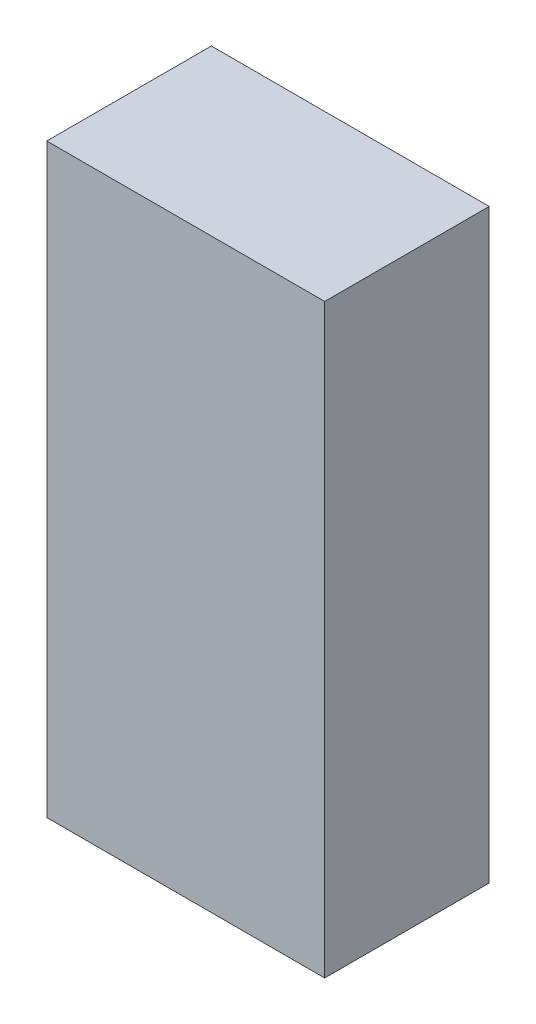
ISO-10303-21;
HEADER;
FILE_DESCRIPTION(('STEP AP214'),'2;1');
FILE_NAME('part.step','',(''),(''),'','','');
FILE_SCHEMA(('AUTOMOTIVE_DESIGN { 1 0 10303 214 1 1 1 1 }'));
ENDSEC;
DATA;
#1=APPLICATION_CONTEXT('core data for automotive mechanical design processes');
#2=APPLICATION_PROTOCOL_DEFINITION('international standard','automotive_design',2000,#1);
#3=PRODUCT_CONTEXT('',#1,'mechanical');
#4=PRODUCT('Part','Part','',(#3));
#5=PRODUCT_RELATED_PRODUCT_CATEGORY('part','',(#4));
#6=PRODUCT_DEFINITION_FORMATION('','',#4);
#7=PRODUCT_DEFINITION_CONTEXT('part definition',#1,'design');
#8=PRODUCT_DEFINITION('design','',#6,#7);
#9=PRODUCT_DEFINITION_SHAPE('','',#8);
#10=(LENGTH_UNIT() NAMED_UNIT(*) SI_UNIT(.MILLI.,.METRE.));
#11=(NAMED_UNIT(*) PLANE_ANGLE_UNIT() SI_UNIT($,.RADIAN.));
#12=(NAMED_UNIT(*) SI_UNIT($,.STERADIAN.) SOLID_ANGLE_UNIT());
#13=UNCERTAINTY_MEASURE_WITH_UNIT(LENGTH_MEASURE(1.E-05),#10,'distance_accuracy_value','');
#14=(GEOMETRIC_REPRESENTATION_CONTEXT(3) GLOBAL_UNCERTAINTY_ASSIGNED_CONTEXT((#13)) GLOBAL_UNIT_ASSIGNED_CONTEXT((#10,
#11,#12)) REPRESENTATION_CONTEXT('',''));
#15=CARTESIAN_POINT('',(0.,0.,0.));
#16=DIRECTION('',(0.,0.,1.));
#17=DIRECTION('',(1.,0.,0.));
#18=AXIS2_PLACEMENT_3D('',#15,#16,#17);
#19=CARTESIAN_POINT('',(0.76000102,1.60250124,0.9));
#20=DIRECTION('',(0.,0.,-1.));
#21=DIRECTION('',(-1.,0.,0.));
#22=AXIS2_PLACEMENT_3D('',#19,#20,#21);
#23=PLANE('',#22);
#24=DIRECTION('',(0.,1.,0.));
#25=VECTOR('',#24,1.);
#26=CARTESIAN_POINT('',(-0.75999848,1.60250124,0.9));
#27=LINE('',#26,#25);
#28=CARTESIAN_POINT('',(-0.75999848,1.60250124,0.9));
#29=VERTEX_POINT('',#28);
#30=CARTESIAN_POINT('',(-0.75999848,-1.6024987,0.9));
#31=VERTEX_POINT('',#30);
#32=EDGE_CURVE('E55',#29,#31,#27,.F.);
#33=ORIENTED_EDGE('',*,*,#32,.T.);
#34=DIRECTION('',(1.,0.,0.));
#35=VECTOR('',#34,1.);
#36=CARTESIAN_POINT('',(-0.75999848,-1.6024987,0.9));
#37=LINE('',#36,#35);
#38=CARTESIAN_POINT('',(0.76000102,-1.6024987,0.9));
#39=VERTEX_POINT('',#38);
#40=EDGE_CURVE('E58',#31,#39,#37,.T.);
#41=ORIENTED_EDGE('',*,*,#40,.T.);
#42=DIRECTION('',(0.,1.,0.));
#43=VECTOR('',#42,1.);
#44=CARTESIAN_POINT('',(0.76000102,-1.6024987,0.9));
#45=LINE('',#44,#43);
#46=CARTESIAN_POINT('',(0.76000102,1.60250124,0.9));
#47=VERTEX_POINT('',#46);
#48=EDGE_CURVE('E60',#39,#47,#45,.T.);
#49=ORIENTED_EDGE('',*,*,#48,.T.);
#50=DIRECTION('',(-1.,0.,0.));
#51=VECTOR('',#50,1.);
#52=CARTESIAN_POINT('',(0.76000102,1.60250124,0.9));
#53=LINE('',#52,#51);
#54=EDGE_CURVE('E20',#29,#47,#53,.F.);
#55=ORIENTED_EDGE('',*,*,#54,.F.);
#56=EDGE_LOOP('',(#33,#41,#49,#55));
#57=FACE_BOUND('',#56,.T.);
#58=ADVANCED_FACE('F17',(#57),#23,.F.);
#59=CARTESIAN_POINT('',(0.76000102,-1.6024987,0.));
#60=DIRECTION('',(-1.,0.,0.));
#61=DIRECTION('',(0.,0.,1.));
#62=AXIS2_PLACEMENT_3D('',#59,#60,#61);
#63=PLANE('',#62);
#64=DIRECTION('',(0.,0.,-1.));
#65=VECTOR('',#64,1.);
#66=CARTESIAN_POINT('',(0.76000102,1.60250124,0.));
#67=LINE('',#66,#65);
#68=CARTESIAN_POINT('',(0.76000102,1.60250124,0.));
#69=VERTEX_POINT('',#68);
#70=EDGE_CURVE('E71',#69,#47,#67,.F.);
#71=ORIENTED_EDGE('',*,*,#70,.T.);
#72=ORIENTED_EDGE('',*,*,#48,.F.);
#73=DIRECTION('',(0.,0.,1.));
#74=VECTOR('',#73,1.);
#75=CARTESIAN_POINT('',(0.76000102,-1.6024987,0.));
#76=LINE('',#75,#74);
#77=CARTESIAN_POINT('',(0.76000102,-1.6024987,0.));
#78=VERTEX_POINT('',#77);
#79=EDGE_CURVE('E65',#39,#78,#76,.F.);
#80=ORIENTED_EDGE('',*,*,#79,.T.);
#81=DIRECTION('',(0.,1.,0.));
#82=VECTOR('',#81,1.);
#83=CARTESIAN_POINT('',(0.76000102,1.60250124,0.));
#84=LINE('',#83,#82);
#85=EDGE_CURVE('E83',#69,#78,#84,.F.);
#86=ORIENTED_EDGE('',*,*,#85,.F.);
#87=EDGE_LOOP('',(#71,#72,#80,#86));
#88=FACE_BOUND('',#87,.T.);
#89=ADVANCED_FACE('F68',(#88),#63,.F.);
#90=CARTESIAN_POINT('',(-0.75999848,-1.6024987,0.));
#91=DIRECTION('',(0.,1.,0.));
#92=DIRECTION('',(0.,0.,1.));
#93=AXIS2_PLACEMENT_3D('',#90,#91,#92);
#94=PLANE('',#93);
#95=ORIENTED_EDGE('',*,*,#79,.F.);
#96=ORIENTED_EDGE('',*,*,#40,.F.);
#97=DIRECTION('',(0.,0.,-1.));
#98=VECTOR('',#97,1.);
#99=CARTESIAN_POINT('',(-0.75999848,-1.6024987,0.));
#100=LINE('',#99,#98);
#101=CARTESIAN_POINT('',(-0.75999848,-1.6024987,0.));
#102=VERTEX_POINT('',#101);
#103=EDGE_CURVE('E77',#31,#102,#100,.T.);
#104=ORIENTED_EDGE('',*,*,#103,.T.);
#105=DIRECTION('',(-1.,0.,0.));
#106=VECTOR('',#105,1.);
#107=CARTESIAN_POINT('',(0.76000102,-1.6024987,0.));
#108=LINE('',#107,#106);
#109=EDGE_CURVE('E74',#78,#102,#108,.T.);
#110=ORIENTED_EDGE('',*,*,#109,.F.);
#111=EDGE_LOOP('',(#95,#96,#104,#110));
#112=FACE_BOUND('',#111,.T.);
#113=ADVANCED_FACE('F72',(#112),#94,.F.);
#114=CARTESIAN_POINT('',(-0.75999848,1.60250124,0.));
#115=DIRECTION('',(1.,0.,0.));
#116=DIRECTION('',(0.,0.,-1.));
#117=AXIS2_PLACEMENT_3D('',#114,#115,#116);
#118=PLANE('',#117);
#119=ORIENTED_EDGE('',*,*,#103,.F.);
#120=ORIENTED_EDGE('',*,*,#32,.F.);
#121=DIRECTION('',(0.,0.,-1.));
#122=VECTOR('',#121,1.);
#123=CARTESIAN_POINT('',(-0.75999848,1.60250124,0.));
#124=LINE('',#123,#122);
#125=CARTESIAN_POINT('',(-0.75999848,1.60250124,0.));
#126=VERTEX_POINT('',#125);
#127=EDGE_CURVE('E35',#29,#126,#124,.T.);
#128=ORIENTED_EDGE('',*,*,#127,.T.);
#129=DIRECTION('',(0.,1.,0.));
#130=VECTOR('',#129,1.);
#131=CARTESIAN_POINT('',(-0.75999848,1.60250124,0.));
#132=LINE('',#131,#130);
#133=EDGE_CURVE('E26',#102,#126,#132,.T.);
#134=ORIENTED_EDGE('',*,*,#133,.F.);
#135=EDGE_LOOP('',(#119,#120,#128,#134));
#136=FACE_BOUND('',#135,.T.);
#137=ADVANCED_FACE('F89',(#136),#118,.F.);
#138=CARTESIAN_POINT('',(0.76000102,1.60250124,0.));
#139=DIRECTION('',(0.,-1.,0.));
#140=DIRECTION('',(0.,0.,-1.));
#141=AXIS2_PLACEMENT_3D('',#138,#139,#140);
#142=PLANE('',#141);
#143=ORIENTED_EDGE('',*,*,#127,.F.);
#144=ORIENTED_EDGE('',*,*,#54,.T.);
#145=ORIENTED_EDGE('',*,*,#70,.F.);
#146=DIRECTION('',(-1.,0.,0.));
#147=VECTOR('',#146,1.);
#148=CARTESIAN_POINT('',(0.76000102,1.60250124,0.));
#149=LINE('',#148,#147);
#150=EDGE_CURVE('E11',#126,#69,#149,.F.);
#151=ORIENTED_EDGE('',*,*,#150,.F.);
#152=EDGE_LOOP('',(#143,#144,#145,#151));
#153=FACE_BOUND('',#152,.T.);
#154=ADVANCED_FACE('F91',(#153),#142,.F.);
#155=CARTESIAN_POINT('',(0.76000102,1.60250124,0.));
#156=DIRECTION('',(0.,0.,-1.));
#157=DIRECTION('',(-1.,0.,0.));
#158=AXIS2_PLACEMENT_3D('',#155,#156,#157);
#159=PLANE('',#158);
#160=ORIENTED_EDGE('',*,*,#133,.T.);
#161=ORIENTED_EDGE('',*,*,#150,.T.);
#162=ORIENTED_EDGE('',*,*,#85,.T.);
#163=ORIENTED_EDGE('',*,*,#109,.T.);
#164=EDGE_LOOP('',(#160,#161,#162,#163));
#165=FACE_BOUND('',#164,.T.);
#166=ADVANCED_FACE('F88',(#165),#159,.T.);
#167=CLOSED_SHELL('',(#58,#89,#113,#137,#154,#166));
#168=MANIFOLD_SOLID_BREP('B1',#167);
#169=ADVANCED_BREP_SHAPE_REPRESENTATION('',(#18,#168),#14);
#170=SHAPE_DEFINITION_REPRESENTATION(#9,#169);
ENDSEC;
END-ISO-10303-21;
